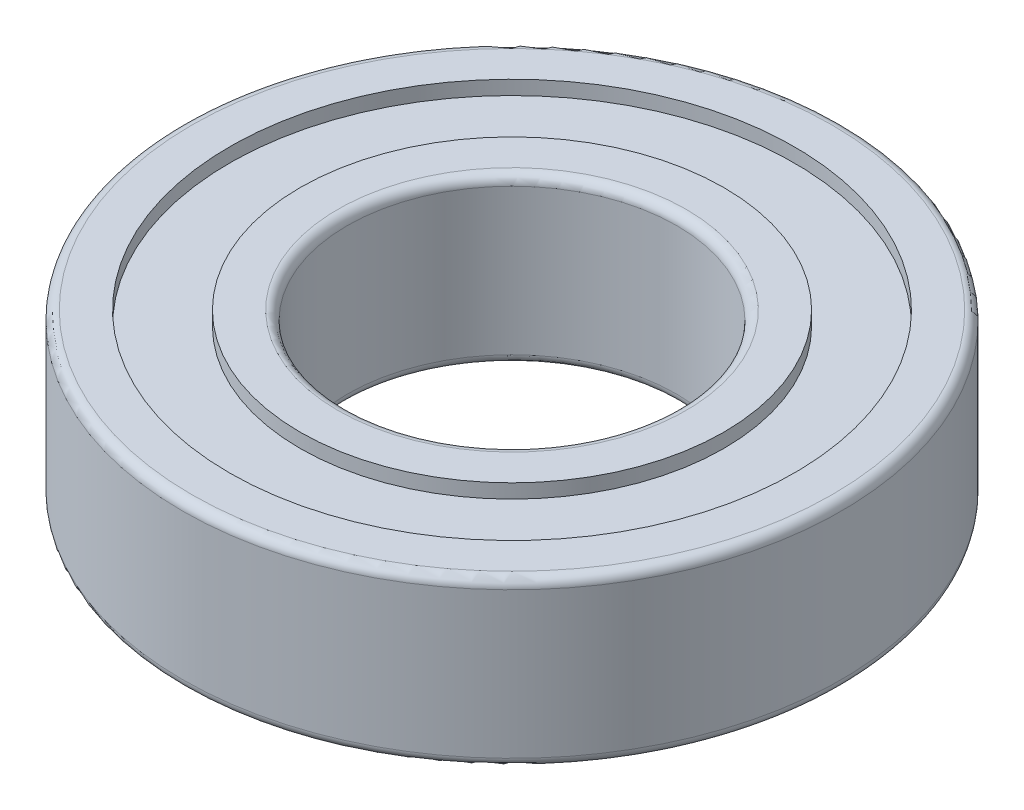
ISO-10303-21;
HEADER;
FILE_DESCRIPTION(('STEP AP214'),'2;1');
FILE_NAME('part.step','',(''),(''),'','','');
FILE_SCHEMA(('AUTOMOTIVE_DESIGN { 1 0 10303 214 1 1 1 1 }'));
ENDSEC;
DATA;
#1=APPLICATION_CONTEXT('core data for automotive mechanical design processes');
#2=APPLICATION_PROTOCOL_DEFINITION('international standard','automotive_design',2000,#1);
#3=PRODUCT_CONTEXT('',#1,'mechanical');
#4=PRODUCT('Part','Part','',(#3));
#5=PRODUCT_RELATED_PRODUCT_CATEGORY('part','',(#4));
#6=PRODUCT_DEFINITION_FORMATION('','',#4);
#7=PRODUCT_DEFINITION_CONTEXT('part definition',#1,'design');
#8=PRODUCT_DEFINITION('design','',#6,#7);
#9=PRODUCT_DEFINITION_SHAPE('','',#8);
#10=(LENGTH_UNIT() NAMED_UNIT(*) SI_UNIT(.MILLI.,.METRE.));
#11=(NAMED_UNIT(*) PLANE_ANGLE_UNIT() SI_UNIT($,.RADIAN.));
#12=(NAMED_UNIT(*) SI_UNIT($,.STERADIAN.) SOLID_ANGLE_UNIT());
#13=UNCERTAINTY_MEASURE_WITH_UNIT(LENGTH_MEASURE(1.E-05),#10,'distance_accuracy_value','');
#14=(GEOMETRIC_REPRESENTATION_CONTEXT(3) GLOBAL_UNCERTAINTY_ASSIGNED_CONTEXT((#13)) GLOBAL_UNIT_ASSIGNED_CONTEXT((#10,
#11,#12)) REPRESENTATION_CONTEXT('',''));
#15=CARTESIAN_POINT('',(0.,0.,0.));
#16=DIRECTION('',(0.,0.,1.));
#17=DIRECTION('',(1.,0.,0.));
#18=AXIS2_PLACEMENT_3D('',#15,#16,#17);
#19=CARTESIAN_POINT('',(0.,-1.175,0.));
#20=DIRECTION('',(0.,1.,0.));
#21=DIRECTION('',(0.,0.,1.));
#22=AXIS2_PLACEMENT_3D('',#19,#20,#21);
#23=CYLINDRICAL_SURFACE('',#22,3.5);
#24=CARTESIAN_POINT('',(0.,2.3,0.));
#25=DIRECTION('',(0.,1.,0.));
#26=DIRECTION('',(0.,0.,-1.));
#27=AXIS2_PLACEMENT_3D('',#24,#25,#26);
#28=CIRCLE('',#27,3.5);
#29=CARTESIAN_POINT('',(0.,2.3,-3.5));
#30=VERTEX_POINT('',#29);
#31=EDGE_CURVE('E60',#30,#30,#28,.F.);
#32=ORIENTED_EDGE('',*,*,#31,.F.);
#33=EDGE_LOOP('',(#32));
#34=FACE_BOUND('',#33,.T.);
#35=CARTESIAN_POINT('',(0.,-0.8,0.));
#36=DIRECTION('',(0.,1.,0.));
#37=DIRECTION('',(0.,0.,-1.));
#38=AXIS2_PLACEMENT_3D('',#35,#36,#37);
#39=CIRCLE('',#38,3.5);
#40=CARTESIAN_POINT('',(0.,-0.8,-3.5));
#41=VERTEX_POINT('',#40);
#42=EDGE_CURVE('E261',#41,#41,#39,.T.);
#43=ORIENTED_EDGE('',*,*,#42,.F.);
#44=EDGE_LOOP('',(#43));
#45=FACE_BOUND('',#44,.T.);
#46=ADVANCED_FACE('F16',(#34,#45),#23,.F.);
#47=CARTESIAN_POINT('',(0.,-0.8,0.));
#48=DIRECTION('',(0.,1.,0.));
#49=DIRECTION('',(0.,0.,-1.));
#50=AXIS2_PLACEMENT_3D('',#47,#48,#49);
#51=TOROIDAL_SURFACE('',#50,3.7,0.2);
#52=CARTESIAN_POINT('',(0.,-1.,0.));
#53=DIRECTION('',(0.,-1.,0.));
#54=DIRECTION('',(0.,0.,-1.));
#55=AXIS2_PLACEMENT_3D('',#52,#53,#54);
#56=CIRCLE('',#55,3.7);
#57=CARTESIAN_POINT('',(0.,-1.,-3.7));
#58=VERTEX_POINT('',#57);
#59=CARTESIAN_POINT('',(0.,-1.,3.7));
#60=VERTEX_POINT('',#59);
#61=EDGE_CURVE('E55',#58,#60,#56,.T.);
#62=ORIENTED_EDGE('',*,*,#61,.T.);
#63=CARTESIAN_POINT('',(0.,-1.,0.));
#64=DIRECTION('',(0.,-1.,0.));
#65=DIRECTION('',(0.,0.,1.));
#66=AXIS2_PLACEMENT_3D('',#63,#64,#65);
#67=CIRCLE('',#66,3.7);
#68=EDGE_CURVE('E52',#60,#58,#67,.T.);
#69=ORIENTED_EDGE('',*,*,#68,.T.);
#70=EDGE_LOOP('',(#62,#69));
#71=FACE_BOUND('',#70,.T.);
#72=ORIENTED_EDGE('',*,*,#42,.T.);
#73=EDGE_LOOP('',(#72));
#74=FACE_BOUND('',#73,.T.);
#75=ADVANCED_FACE('F56',(#71,#74),#51,.T.);
#76=CARTESIAN_POINT('',(0.,2.3,0.));
#77=DIRECTION('',(0.,1.,0.));
#78=DIRECTION('',(0.,0.,-1.));
#79=AXIS2_PLACEMENT_3D('',#76,#77,#78);
#80=TOROIDAL_SURFACE('',#79,3.7,0.2);
#81=ORIENTED_EDGE('',*,*,#31,.T.);
#82=EDGE_LOOP('',(#81));
#83=FACE_BOUND('',#82,.T.);
#84=CARTESIAN_POINT('',(0.,2.5,0.));
#85=DIRECTION('',(0.,1.,0.));
#86=DIRECTION('',(0.,0.,-1.));
#87=AXIS2_PLACEMENT_3D('',#84,#85,#86);
#88=CIRCLE('',#87,3.7);
#89=CARTESIAN_POINT('',(0.,2.5,3.7));
#90=VERTEX_POINT('',#89);
#91=CARTESIAN_POINT('',(0.,2.5,-3.7));
#92=VERTEX_POINT('',#91);
#93=EDGE_CURVE('E223',#90,#92,#88,.F.);
#94=ORIENTED_EDGE('',*,*,#93,.F.);
#95=CARTESIAN_POINT('',(0.,2.5,0.));
#96=DIRECTION('',(0.,1.,0.));
#97=DIRECTION('',(0.,0.,1.));
#98=AXIS2_PLACEMENT_3D('',#95,#96,#97);
#99=CIRCLE('',#98,3.7);
#100=EDGE_CURVE('E65',#92,#90,#99,.F.);
#101=ORIENTED_EDGE('',*,*,#100,.F.);
#102=EDGE_LOOP('',(#94,#101));
#103=FACE_BOUND('',#102,.T.);
#104=ADVANCED_FACE('F86',(#83,#103),#80,.T.);
#105=CARTESIAN_POINT('',(0.,-1.,0.));
#106=DIRECTION('',(0.,1.,0.));
#107=DIRECTION('',(0.,0.,1.));
#108=AXIS2_PLACEMENT_3D('',#105,#106,#107);
#109=PLANE('',#108);
#110=ORIENTED_EDGE('',*,*,#61,.F.);
#111=ORIENTED_EDGE('',*,*,#68,.F.);
#112=EDGE_LOOP('',(#110,#111));
#113=FACE_BOUND('',#112,.T.);
#114=CARTESIAN_POINT('',(0.,-1.,0.));
#115=DIRECTION('',(0.,1.,0.));
#116=DIRECTION('',(0.,0.,1.));
#117=AXIS2_PLACEMENT_3D('',#114,#115,#116);
#118=CIRCLE('',#117,4.5);
#119=CARTESIAN_POINT('',(0.,-1.,4.5));
#120=VERTEX_POINT('',#119);
#121=EDGE_CURVE('E232',#120,#120,#118,.T.);
#122=ORIENTED_EDGE('',*,*,#121,.F.);
#123=EDGE_LOOP('',(#122));
#124=FACE_BOUND('',#123,.T.);
#125=ADVANCED_FACE('F63',(#113,#124),#109,.F.);
#126=CARTESIAN_POINT('',(0.,2.5,0.));
#127=DIRECTION('',(0.,1.,0.));
#128=DIRECTION('',(0.,0.,1.));
#129=AXIS2_PLACEMENT_3D('',#126,#127,#128);
#130=PLANE('',#129);
#131=ORIENTED_EDGE('',*,*,#100,.T.);
#132=ORIENTED_EDGE('',*,*,#93,.T.);
#133=EDGE_LOOP('',(#131,#132));
#134=FACE_BOUND('',#133,.T.);
#135=CARTESIAN_POINT('',(0.,2.5,0.));
#136=DIRECTION('',(0.,1.,0.));
#137=DIRECTION('',(0.,0.,1.));
#138=AXIS2_PLACEMENT_3D('',#135,#136,#137);
#139=CIRCLE('',#138,4.5);
#140=CARTESIAN_POINT('',(0.,2.5,4.5));
#141=VERTEX_POINT('',#140);
#142=EDGE_CURVE('E234',#141,#141,#139,.F.);
#143=ORIENTED_EDGE('',*,*,#142,.F.);
#144=EDGE_LOOP('',(#143));
#145=FACE_BOUND('',#144,.T.);
#146=ADVANCED_FACE('F85',(#134,#145),#130,.T.);
#147=CARTESIAN_POINT('',(0.,-1.175,0.));
#148=DIRECTION('',(0.,1.,0.));
#149=DIRECTION('',(0.,0.,1.));
#150=AXIS2_PLACEMENT_3D('',#147,#148,#149);
#151=CYLINDRICAL_SURFACE('',#150,4.5);
#152=ORIENTED_EDGE('',*,*,#121,.T.);
#153=EDGE_LOOP('',(#152));
#154=FACE_BOUND('',#153,.T.);
#155=CARTESIAN_POINT('',(0.,-0.7,0.));
#156=DIRECTION('',(0.,1.,0.));
#157=DIRECTION('',(0.,0.,1.));
#158=AXIS2_PLACEMENT_3D('',#155,#156,#157);
#159=CIRCLE('',#158,4.5);
#160=CARTESIAN_POINT('',(0.,-0.7,4.5));
#161=VERTEX_POINT('',#160);
#162=EDGE_CURVE('E239',#161,#161,#159,.F.);
#163=ORIENTED_EDGE('',*,*,#162,.T.);
#164=EDGE_LOOP('',(#163));
#165=FACE_BOUND('',#164,.T.);
#166=ADVANCED_FACE('F274',(#154,#165),#151,.T.);
#167=CARTESIAN_POINT('',(0.,-1.175,0.));
#168=DIRECTION('',(0.,1.,0.));
#169=DIRECTION('',(0.,0.,1.));
#170=AXIS2_PLACEMENT_3D('',#167,#168,#169);
#171=CYLINDRICAL_SURFACE('',#170,4.5);
#172=CARTESIAN_POINT('',(0.,2.2,0.));
#173=DIRECTION('',(0.,1.,0.));
#174=DIRECTION('',(0.,0.,1.));
#175=AXIS2_PLACEMENT_3D('',#172,#173,#174);
#176=CIRCLE('',#175,4.5);
#177=CARTESIAN_POINT('',(0.,2.2,4.5));
#178=VERTEX_POINT('',#177);
#179=EDGE_CURVE('E269',#178,#178,#176,.F.);
#180=ORIENTED_EDGE('',*,*,#179,.F.);
#181=EDGE_LOOP('',(#180));
#182=FACE_BOUND('',#181,.T.);
#183=ORIENTED_EDGE('',*,*,#142,.T.);
#184=EDGE_LOOP('',(#183));
#185=FACE_BOUND('',#184,.T.);
#186=ADVANCED_FACE('F280',(#182,#185),#171,.T.);
#187=CARTESIAN_POINT('',(0.,-0.7,0.));
#188=DIRECTION('',(0.,1.,0.));
#189=DIRECTION('',(0.,0.,1.));
#190=AXIS2_PLACEMENT_3D('',#187,#188,#189);
#191=PLANE('',#190);
#192=ORIENTED_EDGE('',*,*,#162,.F.);
#193=EDGE_LOOP('',(#192));
#194=FACE_BOUND('',#193,.T.);
#195=CARTESIAN_POINT('',(0.,-0.7,0.));
#196=DIRECTION('',(0.,1.,0.));
#197=DIRECTION('',(0.,0.,1.));
#198=AXIS2_PLACEMENT_3D('',#195,#196,#197);
#199=CIRCLE('',#198,6.);
#200=CARTESIAN_POINT('',(0.,-0.7,6.));
#201=VERTEX_POINT('',#200);
#202=EDGE_CURVE('E266',#201,#201,#199,.F.);
#203=ORIENTED_EDGE('',*,*,#202,.T.);
#204=EDGE_LOOP('',(#203));
#205=FACE_BOUND('',#204,.T.);
#206=ADVANCED_FACE('F276',(#194,#205),#191,.F.);
#207=CARTESIAN_POINT('',(0.,2.2,0.));
#208=DIRECTION('',(0.,1.,0.));
#209=DIRECTION('',(0.,0.,1.));
#210=AXIS2_PLACEMENT_3D('',#207,#208,#209);
#211=PLANE('',#210);
#212=ORIENTED_EDGE('',*,*,#179,.T.);
#213=EDGE_LOOP('',(#212));
#214=FACE_BOUND('',#213,.T.);
#215=CARTESIAN_POINT('',(0.,2.2,0.));
#216=DIRECTION('',(0.,1.,0.));
#217=DIRECTION('',(0.,0.,1.));
#218=AXIS2_PLACEMENT_3D('',#215,#216,#217);
#219=CIRCLE('',#218,6.);
#220=CARTESIAN_POINT('',(0.,2.2,6.));
#221=VERTEX_POINT('',#220);
#222=EDGE_CURVE('E258',#221,#221,#219,.T.);
#223=ORIENTED_EDGE('',*,*,#222,.T.);
#224=EDGE_LOOP('',(#223));
#225=FACE_BOUND('',#224,.T.);
#226=ADVANCED_FACE('F279',(#214,#225),#211,.T.);
#227=CARTESIAN_POINT('',(0.,-1.175,0.));
#228=DIRECTION('',(0.,1.,0.));
#229=DIRECTION('',(0.,0.,1.));
#230=AXIS2_PLACEMENT_3D('',#227,#228,#229);
#231=CYLINDRICAL_SURFACE('',#230,6.);
#232=ORIENTED_EDGE('',*,*,#202,.F.);
#233=EDGE_LOOP('',(#232));
#234=FACE_BOUND('',#233,.T.);
#235=CARTESIAN_POINT('',(0.,-1.,0.));
#236=DIRECTION('',(0.,1.,0.));
#237=DIRECTION('',(0.,0.,1.));
#238=AXIS2_PLACEMENT_3D('',#235,#236,#237);
#239=CIRCLE('',#238,6.);
#240=CARTESIAN_POINT('',(0.,-1.,6.));
#241=VERTEX_POINT('',#240);
#242=EDGE_CURVE('E253',#241,#241,#239,.F.);
#243=ORIENTED_EDGE('',*,*,#242,.T.);
#244=EDGE_LOOP('',(#243));
#245=FACE_BOUND('',#244,.T.);
#246=ADVANCED_FACE('F284',(#234,#245),#231,.F.);
#247=CARTESIAN_POINT('',(0.,-1.175,0.));
#248=DIRECTION('',(0.,1.,0.));
#249=DIRECTION('',(0.,0.,1.));
#250=AXIS2_PLACEMENT_3D('',#247,#248,#249);
#251=CYLINDRICAL_SURFACE('',#250,6.);
#252=CARTESIAN_POINT('',(0.,2.5,0.));
#253=DIRECTION('',(0.,1.,0.));
#254=DIRECTION('',(0.,0.,1.));
#255=AXIS2_PLACEMENT_3D('',#252,#253,#254);
#256=CIRCLE('',#255,6.);
#257=CARTESIAN_POINT('',(0.,2.5,6.));
#258=VERTEX_POINT('',#257);
#259=EDGE_CURVE('E251',#258,#258,#256,.F.);
#260=ORIENTED_EDGE('',*,*,#259,.F.);
#261=EDGE_LOOP('',(#260));
#262=FACE_BOUND('',#261,.T.);
#263=ORIENTED_EDGE('',*,*,#222,.F.);
#264=EDGE_LOOP('',(#263));
#265=FACE_BOUND('',#264,.T.);
#266=ADVANCED_FACE('F188',(#262,#265),#251,.F.);
#267=CARTESIAN_POINT('',(0.,-1.,0.));
#268=DIRECTION('',(0.,1.,0.));
#269=DIRECTION('',(0.,0.,1.));
#270=AXIS2_PLACEMENT_3D('',#267,#268,#269);
#271=PLANE('',#270);
#272=ORIENTED_EDGE('',*,*,#242,.F.);
#273=EDGE_LOOP('',(#272));
#274=FACE_BOUND('',#273,.T.);
#275=CARTESIAN_POINT('',(0.,-1.,0.));
#276=DIRECTION('',(0.,1.,0.));
#277=DIRECTION('',(0.,0.,-1.));
#278=AXIS2_PLACEMENT_3D('',#275,#276,#277);
#279=CIRCLE('',#278,6.8);
#280=CARTESIAN_POINT('',(0.,-1.,-6.8));
#281=VERTEX_POINT('',#280);
#282=CARTESIAN_POINT('',(0.,-1.,6.8));
#283=VERTEX_POINT('',#282);
#284=EDGE_CURVE('E173',#281,#283,#279,.T.);
#285=ORIENTED_EDGE('',*,*,#284,.F.);
#286=CARTESIAN_POINT('',(0.,-1.,0.));
#287=DIRECTION('',(0.,1.,0.));
#288=DIRECTION('',(0.,0.,1.));
#289=AXIS2_PLACEMENT_3D('',#286,#287,#288);
#290=CIRCLE('',#289,6.8);
#291=EDGE_CURVE('E201',#283,#281,#290,.T.);
#292=ORIENTED_EDGE('',*,*,#291,.F.);
#293=EDGE_LOOP('',(#285,#292));
#294=FACE_BOUND('',#293,.T.);
#295=ADVANCED_FACE('F179',(#274,#294),#271,.F.);
#296=CARTESIAN_POINT('',(0.,2.5,0.));
#297=DIRECTION('',(0.,1.,0.));
#298=DIRECTION('',(0.,0.,1.));
#299=AXIS2_PLACEMENT_3D('',#296,#297,#298);
#300=PLANE('',#299);
#301=ORIENTED_EDGE('',*,*,#259,.T.);
#302=EDGE_LOOP('',(#301));
#303=FACE_BOUND('',#302,.T.);
#304=CARTESIAN_POINT('',(0.,2.5,0.));
#305=DIRECTION('',(0.,-1.,0.));
#306=DIRECTION('',(0.,0.,1.));
#307=AXIS2_PLACEMENT_3D('',#304,#305,#306);
#308=CIRCLE('',#307,6.8);
#309=CARTESIAN_POINT('',(0.,2.5,6.8));
#310=VERTEX_POINT('',#309);
#311=CARTESIAN_POINT('',(0.,2.5,-6.8));
#312=VERTEX_POINT('',#311);
#313=EDGE_CURVE('E34',#310,#312,#308,.T.);
#314=ORIENTED_EDGE('',*,*,#313,.F.);
#315=CARTESIAN_POINT('',(0.,2.5,0.));
#316=DIRECTION('',(0.,-1.,0.));
#317=DIRECTION('',(0.,0.,-1.));
#318=AXIS2_PLACEMENT_3D('',#315,#316,#317);
#319=CIRCLE('',#318,6.8);
#320=EDGE_CURVE('E150',#312,#310,#319,.T.);
#321=ORIENTED_EDGE('',*,*,#320,.F.);
#322=EDGE_LOOP('',(#314,#321));
#323=FACE_BOUND('',#322,.T.);
#324=ADVANCED_FACE('F129',(#303,#323),#300,.T.);
#325=CARTESIAN_POINT('',(0.,-0.8,0.));
#326=DIRECTION('',(0.,1.,0.));
#327=DIRECTION('',(0.,0.,-1.));
#328=AXIS2_PLACEMENT_3D('',#325,#326,#327);
#329=TOROIDAL_SURFACE('',#328,6.8,0.2);
#330=CARTESIAN_POINT('',(0.,-0.8,0.));
#331=DIRECTION('',(0.,1.,0.));
#332=DIRECTION('',(0.,0.,1.));
#333=AXIS2_PLACEMENT_3D('',#330,#331,#332);
#334=CIRCLE('',#333,7.);
#335=CARTESIAN_POINT('',(0.,-0.8,7.));
#336=VERTEX_POINT('',#335);
#337=EDGE_CURVE('E26',#336,#336,#334,.T.);
#338=ORIENTED_EDGE('',*,*,#337,.F.);
#339=EDGE_LOOP('',(#338));
#340=FACE_BOUND('',#339,.T.);
#341=ORIENTED_EDGE('',*,*,#291,.T.);
#342=ORIENTED_EDGE('',*,*,#284,.T.);
#343=EDGE_LOOP('',(#341,#342));
#344=FACE_BOUND('',#343,.T.);
#345=ADVANCED_FACE('F117',(#340,#344),#329,.T.);
#346=CARTESIAN_POINT('',(0.,2.3,0.));
#347=DIRECTION('',(0.,1.,0.));
#348=DIRECTION('',(0.,0.,-1.));
#349=AXIS2_PLACEMENT_3D('',#346,#347,#348);
#350=TOROIDAL_SURFACE('',#349,6.8,0.2);
#351=ORIENTED_EDGE('',*,*,#313,.T.);
#352=ORIENTED_EDGE('',*,*,#320,.T.);
#353=EDGE_LOOP('',(#351,#352));
#354=FACE_BOUND('',#353,.T.);
#355=CARTESIAN_POINT('',(0.,2.3,0.));
#356=DIRECTION('',(0.,1.,0.));
#357=DIRECTION('',(0.,0.,1.));
#358=AXIS2_PLACEMENT_3D('',#355,#356,#357);
#359=CIRCLE('',#358,7.);
#360=CARTESIAN_POINT('',(0.,2.3,7.));
#361=VERTEX_POINT('',#360);
#362=EDGE_CURVE('E11',#361,#361,#359,.F.);
#363=ORIENTED_EDGE('',*,*,#362,.F.);
#364=EDGE_LOOP('',(#363));
#365=FACE_BOUND('',#364,.T.);
#366=ADVANCED_FACE('F128',(#354,#365),#350,.T.);
#367=CARTESIAN_POINT('',(0.,-1.175,0.));
#368=DIRECTION('',(0.,1.,0.));
#369=DIRECTION('',(0.,0.,1.));
#370=AXIS2_PLACEMENT_3D('',#367,#368,#369);
#371=CYLINDRICAL_SURFACE('',#370,7.);
#372=ORIENTED_EDGE('',*,*,#362,.T.);
#373=EDGE_LOOP('',(#372));
#374=FACE_BOUND('',#373,.T.);
#375=ORIENTED_EDGE('',*,*,#337,.T.);
#376=EDGE_LOOP('',(#375));
#377=FACE_BOUND('',#376,.T.);
#378=ADVANCED_FACE('F296',(#374,#377),#371,.T.);
#379=CLOSED_SHELL('',(#46,#75,#104,#125,#146,#166,#186,#206,#226,#246,#266,#295,#324,#345,#366,#378));
#380=MANIFOLD_SOLID_BREP('B1',#379);
#381=ADVANCED_BREP_SHAPE_REPRESENTATION('',(#18,#380),#14);
#382=SHAPE_DEFINITION_REPRESENTATION(#9,#381);
ENDSEC;
END-ISO-10303-21;
